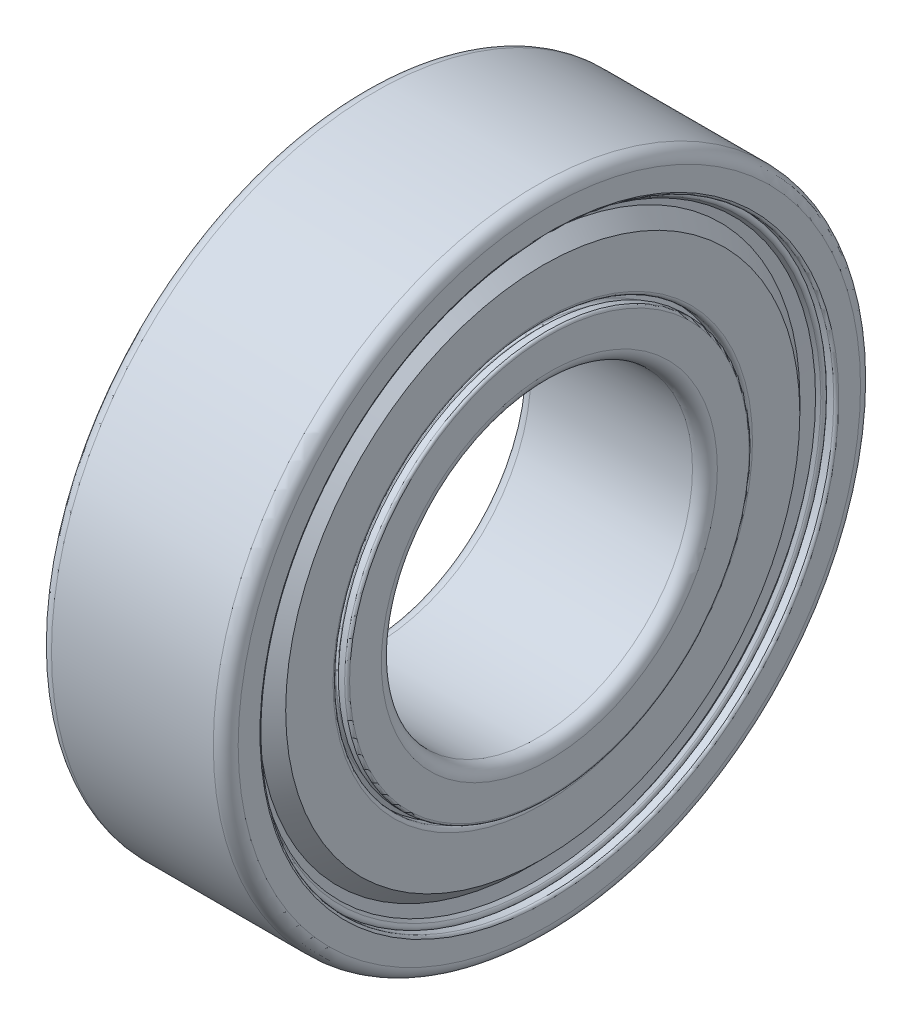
ISO-10303-21;
HEADER;
FILE_DESCRIPTION(('STEP AP214'),'2;1');
FILE_NAME('part.step','',(''),(''),'','','');
FILE_SCHEMA(('AUTOMOTIVE_DESIGN { 1 0 10303 214 1 1 1 1 }'));
ENDSEC;
DATA;
#1=APPLICATION_CONTEXT('core data for automotive mechanical design processes');
#2=APPLICATION_PROTOCOL_DEFINITION('international standard','automotive_design',2000,#1);
#3=PRODUCT_CONTEXT('',#1,'mechanical');
#4=PRODUCT('Part','Part','',(#3));
#5=PRODUCT_RELATED_PRODUCT_CATEGORY('part','',(#4));
#6=PRODUCT_DEFINITION_FORMATION('','',#4);
#7=PRODUCT_DEFINITION_CONTEXT('part definition',#1,'design');
#8=PRODUCT_DEFINITION('design','',#6,#7);
#9=PRODUCT_DEFINITION_SHAPE('','',#8);
#10=(LENGTH_UNIT() NAMED_UNIT(*) SI_UNIT(.MILLI.,.METRE.));
#11=(NAMED_UNIT(*) PLANE_ANGLE_UNIT() SI_UNIT($,.RADIAN.));
#12=(NAMED_UNIT(*) SI_UNIT($,.STERADIAN.) SOLID_ANGLE_UNIT());
#13=UNCERTAINTY_MEASURE_WITH_UNIT(LENGTH_MEASURE(1.E-05),#10,'distance_accuracy_value','');
#14=(GEOMETRIC_REPRESENTATION_CONTEXT(3) GLOBAL_UNCERTAINTY_ASSIGNED_CONTEXT((#13)) GLOBAL_UNIT_ASSIGNED_CONTEXT((#10,
#11,#12)) REPRESENTATION_CONTEXT('',''));
#15=CARTESIAN_POINT('',(0.,0.,0.));
#16=DIRECTION('',(0.,0.,1.));
#17=DIRECTION('',(1.,0.,0.));
#18=AXIS2_PLACEMENT_3D('',#15,#16,#17);
#19=CARTESIAN_POINT('',(14.,0.,0.));
#20=DIRECTION('',(-1.,0.,0.));
#21=DIRECTION('',(0.,0.,1.));
#22=AXIS2_PLACEMENT_3D('',#19,#20,#21);
#23=CYLINDRICAL_SURFACE('',#22,12.5);
#24=CARTESIAN_POINT('',(1.,0.,0.));
#25=DIRECTION('',(1.,0.,0.));
#26=DIRECTION('',(0.,0.,-1.));
#27=AXIS2_PLACEMENT_3D('',#24,#25,#26);
#28=CIRCLE('',#27,12.5);
#29=CARTESIAN_POINT('',(1.,0.,-12.5));
#30=VERTEX_POINT('',#29);
#31=EDGE_CURVE('E619',#30,#30,#28,.T.);
#32=ORIENTED_EDGE('',*,*,#31,.F.);
#33=EDGE_LOOP('',(#32));
#34=FACE_BOUND('',#33,.T.);
#35=CARTESIAN_POINT('',(14.,0.,0.));
#36=DIRECTION('',(1.,0.,0.));
#37=DIRECTION('',(0.,0.,-1.));
#38=AXIS2_PLACEMENT_3D('',#35,#36,#37);
#39=CIRCLE('',#38,12.5);
#40=CARTESIAN_POINT('',(14.,0.,-12.5));
#41=VERTEX_POINT('',#40);
#42=EDGE_CURVE('E616',#41,#41,#39,.F.);
#43=ORIENTED_EDGE('',*,*,#42,.F.);
#44=EDGE_LOOP('',(#43));
#45=FACE_BOUND('',#44,.T.);
#46=ADVANCED_FACE('F14',(#34,#45),#23,.F.);
#47=CARTESIAN_POINT('',(1.,0.,0.));
#48=DIRECTION('',(1.,0.,0.));
#49=DIRECTION('',(0.,0.,-1.));
#50=AXIS2_PLACEMENT_3D('',#47,#48,#49);
#51=TOROIDAL_SURFACE('',#50,13.5,1.);
#52=CARTESIAN_POINT('',(0.,0.,0.));
#53=DIRECTION('',(-1.,0.,0.));
#54=DIRECTION('',(0.,0.,-1.));
#55=AXIS2_PLACEMENT_3D('',#52,#53,#54);
#56=CIRCLE('',#55,13.5);
#57=CARTESIAN_POINT('',(0.,0.,-13.5));
#58=VERTEX_POINT('',#57);
#59=EDGE_CURVE('E572',#58,#58,#56,.F.);
#60=ORIENTED_EDGE('',*,*,#59,.F.);
#61=EDGE_LOOP('',(#60));
#62=FACE_BOUND('',#61,.T.);
#63=ORIENTED_EDGE('',*,*,#31,.T.);
#64=EDGE_LOOP('',(#63));
#65=FACE_BOUND('',#64,.T.);
#66=ADVANCED_FACE('F638',(#62,#65),#51,.T.);
#67=CARTESIAN_POINT('',(14.,0.,0.));
#68=DIRECTION('',(1.,0.,0.));
#69=DIRECTION('',(0.,0.,-1.));
#70=AXIS2_PLACEMENT_3D('',#67,#68,#69);
#71=TOROIDAL_SURFACE('',#70,13.5,1.);
#72=ORIENTED_EDGE('',*,*,#42,.T.);
#73=EDGE_LOOP('',(#72));
#74=FACE_BOUND('',#73,.T.);
#75=CARTESIAN_POINT('',(15.,0.,0.));
#76=DIRECTION('',(1.,0.,0.));
#77=DIRECTION('',(0.,0.,-1.));
#78=AXIS2_PLACEMENT_3D('',#75,#76,#77);
#79=CIRCLE('',#78,13.5);
#80=CARTESIAN_POINT('',(15.,0.,-13.5));
#81=VERTEX_POINT('',#80);
#82=EDGE_CURVE('E626',#81,#81,#79,.F.);
#83=ORIENTED_EDGE('',*,*,#82,.F.);
#84=EDGE_LOOP('',(#83));
#85=FACE_BOUND('',#84,.T.);
#86=ADVANCED_FACE('F589',(#74,#85),#71,.T.);
#87=CARTESIAN_POINT('',(0.,16.05,0.));
#88=DIRECTION('',(-1.,0.,0.));
#89=DIRECTION('',(0.,0.,1.));
#90=AXIS2_PLACEMENT_3D('',#87,#88,#89);
#91=PLANE('',#90);
#92=CARTESIAN_POINT('',(0.,0.,0.));
#93=DIRECTION('',(1.,0.,0.));
#94=DIRECTION('',(0.,0.,-1.));
#95=AXIS2_PLACEMENT_3D('',#92,#93,#94);
#96=CIRCLE('',#95,16.05);
#97=CARTESIAN_POINT('',(0.,0.,-16.05));
#98=VERTEX_POINT('',#97);
#99=EDGE_CURVE('E606',#98,#98,#96,.T.);
#100=ORIENTED_EDGE('',*,*,#99,.F.);
#101=EDGE_LOOP('',(#100));
#102=FACE_BOUND('',#101,.T.);
#103=ORIENTED_EDGE('',*,*,#59,.T.);
#104=EDGE_LOOP('',(#103));
#105=FACE_BOUND('',#104,.T.);
#106=ADVANCED_FACE('F579',(#102,#105),#91,.T.);
#107=CARTESIAN_POINT('',(15.,13.5,0.));
#108=DIRECTION('',(1.,0.,0.));
#109=DIRECTION('',(0.,0.,-1.));
#110=AXIS2_PLACEMENT_3D('',#107,#108,#109);
#111=PLANE('',#110);
#112=ORIENTED_EDGE('',*,*,#82,.T.);
#113=EDGE_LOOP('',(#112));
#114=FACE_BOUND('',#113,.T.);
#115=CARTESIAN_POINT('',(15.,0.,0.));
#116=DIRECTION('',(-1.,0.,0.));
#117=DIRECTION('',(0.,0.,-1.));
#118=AXIS2_PLACEMENT_3D('',#115,#116,#117);
#119=CIRCLE('',#118,16.05);
#120=CARTESIAN_POINT('',(15.,0.,-16.05));
#121=VERTEX_POINT('',#120);
#122=EDGE_CURVE('E537',#121,#121,#119,.T.);
#123=ORIENTED_EDGE('',*,*,#122,.F.);
#124=EDGE_LOOP('',(#123));
#125=FACE_BOUND('',#124,.T.);
#126=ADVANCED_FACE('F588',(#114,#125),#111,.T.);
#127=CARTESIAN_POINT('',(0.199999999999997,0.,0.));
#128=DIRECTION('',(1.,0.,0.));
#129=DIRECTION('',(0.,0.,-1.));
#130=AXIS2_PLACEMENT_3D('',#127,#128,#129);
#131=TOROIDAL_SURFACE('',#130,16.05,0.199999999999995);
#132=CARTESIAN_POINT('',(0.200000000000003,0.,0.));
#133=DIRECTION('',(-1.,0.,0.));
#134=DIRECTION('',(0.,0.,1.));
#135=AXIS2_PLACEMENT_3D('',#132,#133,#134);
#136=CIRCLE('',#135,16.25);
#137=CARTESIAN_POINT('',(0.200000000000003,0.,16.25));
#138=VERTEX_POINT('',#137);
#139=EDGE_CURVE('E532',#138,#138,#136,.F.);
#140=ORIENTED_EDGE('',*,*,#139,.F.);
#141=EDGE_LOOP('',(#140));
#142=FACE_BOUND('',#141,.T.);
#143=ORIENTED_EDGE('',*,*,#99,.T.);
#144=EDGE_LOOP('',(#143));
#145=FACE_BOUND('',#144,.T.);
#146=ADVANCED_FACE('F551',(#142,#145),#131,.T.);
#147=CARTESIAN_POINT('',(14.8,0.,0.));
#148=DIRECTION('',(1.,0.,0.));
#149=DIRECTION('',(0.,0.,-1.));
#150=AXIS2_PLACEMENT_3D('',#147,#148,#149);
#151=TOROIDAL_SURFACE('',#150,16.05,0.199999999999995);
#152=ORIENTED_EDGE('',*,*,#122,.T.);
#153=EDGE_LOOP('',(#152));
#154=FACE_BOUND('',#153,.T.);
#155=CARTESIAN_POINT('',(14.8,0.,0.));
#156=DIRECTION('',(-1.,0.,0.));
#157=DIRECTION('',(0.,0.,1.));
#158=AXIS2_PLACEMENT_3D('',#155,#156,#157);
#159=CIRCLE('',#158,16.25);
#160=CARTESIAN_POINT('',(14.8,0.,16.25));
#161=VERTEX_POINT('',#160);
#162=EDGE_CURVE('E527',#161,#161,#159,.T.);
#163=ORIENTED_EDGE('',*,*,#162,.F.);
#164=EDGE_LOOP('',(#163));
#165=FACE_BOUND('',#164,.T.);
#166=ADVANCED_FACE('F545',(#154,#165),#151,.T.);
#167=CARTESIAN_POINT('',(14.,0.,0.));
#168=DIRECTION('',(-1.,0.,0.));
#169=DIRECTION('',(0.,0.,1.));
#170=AXIS2_PLACEMENT_3D('',#167,#168,#169);
#171=CYLINDRICAL_SURFACE('',#170,16.25);
#172=CARTESIAN_POINT('',(0.700000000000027,0.,0.));
#173=DIRECTION('',(-1.,0.,0.));
#174=DIRECTION('',(0.,0.,1.));
#175=AXIS2_PLACEMENT_3D('',#172,#173,#174);
#176=CIRCLE('',#175,16.25);
#177=CARTESIAN_POINT('',(0.700000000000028,0.,16.25));
#178=VERTEX_POINT('',#177);
#179=EDGE_CURVE('E522',#178,#178,#176,.F.);
#180=ORIENTED_EDGE('',*,*,#179,.F.);
#181=EDGE_LOOP('',(#180));
#182=FACE_BOUND('',#181,.T.);
#183=ORIENTED_EDGE('',*,*,#139,.T.);
#184=EDGE_LOOP('',(#183));
#185=FACE_BOUND('',#184,.T.);
#186=ADVANCED_FACE('F550',(#182,#185),#171,.T.);
#187=CARTESIAN_POINT('',(14.,0.,0.));
#188=DIRECTION('',(-1.,0.,0.));
#189=DIRECTION('',(0.,0.,1.));
#190=AXIS2_PLACEMENT_3D('',#187,#188,#189);
#191=CYLINDRICAL_SURFACE('',#190,16.25);
#192=ORIENTED_EDGE('',*,*,#162,.T.);
#193=EDGE_LOOP('',(#192));
#194=FACE_BOUND('',#193,.T.);
#195=CARTESIAN_POINT('',(14.3,0.,0.));
#196=DIRECTION('',(1.,0.,0.));
#197=DIRECTION('',(0.,0.,-1.));
#198=AXIS2_PLACEMENT_3D('',#195,#196,#197);
#199=CIRCLE('',#198,16.25);
#200=CARTESIAN_POINT('',(14.3,0.,-16.25));
#201=VERTEX_POINT('',#200);
#202=EDGE_CURVE('E517',#201,#201,#199,.F.);
#203=ORIENTED_EDGE('',*,*,#202,.F.);
#204=EDGE_LOOP('',(#203));
#205=FACE_BOUND('',#204,.T.);
#206=ADVANCED_FACE('F1220',(#194,#205),#191,.T.);
#207=CARTESIAN_POINT('',(0.700000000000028,0.,0.));
#208=DIRECTION('',(-1.,0.,0.));
#209=DIRECTION('',(0.,0.,1.));
#210=AXIS2_PLACEMENT_3D('',#207,#208,#209);
#211=CONICAL_SURFACE('',#210,16.25,0.785398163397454);
#212=CARTESIAN_POINT('',(1.07466437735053,0.,0.));
#213=DIRECTION('',(1.,0.,0.));
#214=DIRECTION('',(0.,0.,-1.));
#215=AXIS2_PLACEMENT_3D('',#212,#213,#214);
#216=CIRCLE('',#215,15.8753356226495);
#217=CARTESIAN_POINT('',(1.07466437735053,0.,-15.8753356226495));
#218=VERTEX_POINT('',#217);
#219=EDGE_CURVE('E511',#218,#218,#216,.F.);
#220=ORIENTED_EDGE('',*,*,#219,.T.);
#221=EDGE_LOOP('',(#220));
#222=FACE_BOUND('',#221,.T.);
#223=ORIENTED_EDGE('',*,*,#179,.T.);
#224=EDGE_LOOP('',(#223));
#225=FACE_BOUND('',#224,.T.);
#226=ADVANCED_FACE('F1213',(#222,#225),#211,.T.);
#227=CARTESIAN_POINT('',(14.3,0.,0.));
#228=DIRECTION('',(1.,0.,0.));
#229=DIRECTION('',(0.,0.,-1.));
#230=AXIS2_PLACEMENT_3D('',#227,#228,#229);
#231=CONICAL_SURFACE('',#230,16.25,0.785398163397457);
#232=ORIENTED_EDGE('',*,*,#202,.T.);
#233=EDGE_LOOP('',(#232));
#234=FACE_BOUND('',#233,.T.);
#235=CARTESIAN_POINT('',(13.9252967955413,0.,0.));
#236=DIRECTION('',(1.,0.,0.));
#237=DIRECTION('',(0.,0.,-1.));
#238=AXIS2_PLACEMENT_3D('',#235,#236,#237);
#239=CIRCLE('',#238,15.8752967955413);
#240=CARTESIAN_POINT('',(13.9252967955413,0.,-15.8752967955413));
#241=VERTEX_POINT('',#240);
#242=EDGE_CURVE('E508',#241,#241,#239,.T.);
#243=ORIENTED_EDGE('',*,*,#242,.T.);
#244=EDGE_LOOP('',(#243));
#245=FACE_BOUND('',#244,.T.);
#246=ADVANCED_FACE('F1206',(#234,#245),#231,.T.);
#247=CARTESIAN_POINT('',(1.49892900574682,0.,0.));
#248=DIRECTION('',(1.,0.,0.));
#249=DIRECTION('',(0.,0.,-1.));
#250=AXIS2_PLACEMENT_3D('',#247,#248,#249);
#251=TOROIDAL_SURFACE('',#250,16.2995991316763,0.599999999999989);
#252=ORIENTED_EDGE('',*,*,#219,.F.);
#253=EDGE_LOOP('',(#252));
#254=FACE_BOUND('',#253,.T.);
#255=CARTESIAN_POINT('',(1.47699999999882,0.,0.));
#256=DIRECTION('',(1.,0.,0.));
#257=DIRECTION('',(0.,0.,-1.));
#258=AXIS2_PLACEMENT_3D('',#255,#256,#257);
#259=CIRCLE('',#258,15.7);
#260=CARTESIAN_POINT('',(1.47699999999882,0.,-15.7));
#261=VERTEX_POINT('',#260);
#262=EDGE_CURVE('E487',#261,#261,#259,.F.);
#263=ORIENTED_EDGE('',*,*,#262,.T.);
#264=EDGE_LOOP('',(#263));
#265=FACE_BOUND('',#264,.T.);
#266=ADVANCED_FACE('F501',(#254,#265),#251,.F.);
#267=CARTESIAN_POINT('',(13.5010320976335,0.,0.));
#268=DIRECTION('',(1.,0.,0.));
#269=DIRECTION('',(0.,0.,-1.));
#270=AXIS2_PLACEMENT_3D('',#267,#268,#269);
#271=TOROIDAL_SURFACE('',#270,16.2995602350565,0.600000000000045);
#272=CARTESIAN_POINT('',(13.5239999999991,0.,0.));
#273=DIRECTION('',(1.,0.,0.));
#274=DIRECTION('',(0.,0.,-1.));
#275=AXIS2_PLACEMENT_3D('',#272,#273,#274);
#276=CIRCLE('',#275,15.7);
#277=CARTESIAN_POINT('',(13.5239999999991,0.,-15.7));
#278=VERTEX_POINT('',#277);
#279=EDGE_CURVE('E481',#278,#278,#276,.T.);
#280=ORIENTED_EDGE('',*,*,#279,.T.);
#281=EDGE_LOOP('',(#280));
#282=FACE_BOUND('',#281,.T.);
#283=ORIENTED_EDGE('',*,*,#242,.F.);
#284=EDGE_LOOP('',(#283));
#285=FACE_BOUND('',#284,.T.);
#286=ADVANCED_FACE('F496',(#282,#285),#271,.F.);
#287=CARTESIAN_POINT('',(1.49074818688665,0.,0.));
#288=DIRECTION('',(1.,0.,0.));
#289=DIRECTION('',(0.,0.,-1.));
#290=AXIS2_PLACEMENT_3D('',#287,#288,#289);
#291=TOROIDAL_SURFACE('',#290,16.2998424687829,0.599999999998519);
#292=ORIENTED_EDGE('',*,*,#262,.F.);
#293=EDGE_LOOP('',(#292));
#294=FACE_BOUND('',#293,.T.);
#295=CARTESIAN_POINT('',(1.52800000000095,0.,0.));
#296=DIRECTION('',(1.,0.,0.));
#297=DIRECTION('',(0.,0.,-1.));
#298=AXIS2_PLACEMENT_3D('',#295,#296,#297);
#299=CIRCLE('',#298,15.701);
#300=CARTESIAN_POINT('',(1.52800000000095,0.,-15.701));
#301=VERTEX_POINT('',#300);
#302=EDGE_CURVE('E478',#301,#301,#299,.F.);
#303=ORIENTED_EDGE('',*,*,#302,.T.);
#304=EDGE_LOOP('',(#303));
#305=FACE_BOUND('',#304,.T.);
#306=ADVANCED_FACE('F493',(#294,#305),#291,.F.);
#307=CARTESIAN_POINT('',(13.5102518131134,0.,0.));
#308=DIRECTION('',(1.,0.,0.));
#309=DIRECTION('',(0.,0.,-1.));
#310=AXIS2_PLACEMENT_3D('',#307,#308,#309);
#311=TOROIDAL_SURFACE('',#310,16.2998424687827,0.599999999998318);
#312=CARTESIAN_POINT('',(13.4729999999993,0.,0.));
#313=DIRECTION('',(1.,0.,0.));
#314=DIRECTION('',(0.,0.,-1.));
#315=AXIS2_PLACEMENT_3D('',#312,#313,#314);
#316=CIRCLE('',#315,15.701);
#317=CARTESIAN_POINT('',(13.4729999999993,0.,-15.701));
#318=VERTEX_POINT('',#317);
#319=EDGE_CURVE('E455',#318,#318,#316,.T.);
#320=ORIENTED_EDGE('',*,*,#319,.T.);
#321=EDGE_LOOP('',(#320));
#322=FACE_BOUND('',#321,.T.);
#323=ORIENTED_EDGE('',*,*,#279,.F.);
#324=EDGE_LOOP('',(#323));
#325=FACE_BOUND('',#324,.T.);
#326=ADVANCED_FACE('F471',(#322,#325),#311,.F.);
#327=CARTESIAN_POINT('',(1.50012717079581,0.,0.));
#328=DIRECTION('',(1.,0.,0.));
#329=DIRECTION('',(0.,0.,-1.));
#330=AXIS2_PLACEMENT_3D('',#327,#328,#329);
#331=TOROIDAL_SURFACE('',#330,15.9997023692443,0.300000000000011);
#332=ORIENTED_EDGE('',*,*,#302,.F.);
#333=EDGE_LOOP('',(#332));
#334=FACE_BOUND('',#333,.T.);
#335=CARTESIAN_POINT('',(1.78208939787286,0.,0.));
#336=DIRECTION('',(1.,0.,0.));
#337=DIRECTION('',(0.,0.,-1.));
#338=AXIS2_PLACEMENT_3D('',#335,#336,#337);
#339=CIRCLE('',#338,15.8972460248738);
#340=CARTESIAN_POINT('',(1.78208939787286,0.,-15.8972460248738));
#341=VERTEX_POINT('',#340);
#342=EDGE_CURVE('E450',#341,#341,#339,.T.);
#343=ORIENTED_EDGE('',*,*,#342,.F.);
#344=EDGE_LOOP('',(#343));
#345=FACE_BOUND('',#344,.T.);
#346=ADVANCED_FACE('F466',(#334,#345),#331,.F.);
#347=CARTESIAN_POINT('',(13.4998384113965,0.,0.));
#348=DIRECTION('',(1.,0.,0.));
#349=DIRECTION('',(0.,0.,-1.));
#350=AXIS2_PLACEMENT_3D('',#347,#348,#349);
#351=TOROIDAL_SURFACE('',#350,15.9997970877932,0.3);
#352=CARTESIAN_POINT('',(13.2178761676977,0.,0.));
#353=DIRECTION('',(-1.,0.,0.));
#354=DIRECTION('',(0.,0.,1.));
#355=AXIS2_PLACEMENT_3D('',#352,#353,#354);
#356=CIRCLE('',#355,15.8973407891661);
#357=CARTESIAN_POINT('',(13.2178761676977,0.,15.8973407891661));
#358=VERTEX_POINT('',#357);
#359=EDGE_CURVE('E445',#358,#358,#356,.T.);
#360=ORIENTED_EDGE('',*,*,#359,.F.);
#361=EDGE_LOOP('',(#360));
#362=FACE_BOUND('',#361,.T.);
#363=ORIENTED_EDGE('',*,*,#319,.F.);
#364=EDGE_LOOP('',(#363));
#365=FACE_BOUND('',#364,.T.);
#366=ADVANCED_FACE('F462',(#362,#365),#351,.F.);
#367=CARTESIAN_POINT('',(2.15311053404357,0.,0.));
#368=DIRECTION('',(1.,0.,0.));
#369=DIRECTION('',(0.,0.,-1.));
#370=AXIS2_PLACEMENT_3D('',#367,#368,#369);
#371=CONICAL_SURFACE('',#370,16.9183041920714,1.22226126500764);
#372=CARTESIAN_POINT('',(2.15311053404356,0.,0.));
#373=DIRECTION('',(1.,0.,0.));
#374=DIRECTION('',(0.,0.,-1.));
#375=AXIS2_PLACEMENT_3D('',#372,#373,#374);
#376=CIRCLE('',#375,16.9183041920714);
#377=CARTESIAN_POINT('',(2.15311053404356,0.,-16.9183041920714));
#378=VERTEX_POINT('',#377);
#379=EDGE_CURVE('E442',#378,#378,#376,.T.);
#380=ORIENTED_EDGE('',*,*,#379,.F.);
#381=EDGE_LOOP('',(#380));
#382=FACE_BOUND('',#381,.T.);
#383=ORIENTED_EDGE('',*,*,#342,.T.);
#384=EDGE_LOOP('',(#383));
#385=FACE_BOUND('',#384,.T.);
#386=ADVANCED_FACE('F465',(#382,#385),#371,.T.);
#387=CARTESIAN_POINT('',(12.8468894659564,0.,0.));
#388=DIRECTION('',(-1.,0.,0.));
#389=DIRECTION('',(0.,0.,1.));
#390=AXIS2_PLACEMENT_3D('',#387,#388,#389);
#391=CONICAL_SURFACE('',#390,16.9183041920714,1.22226126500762);
#392=ORIENTED_EDGE('',*,*,#359,.T.);
#393=EDGE_LOOP('',(#392));
#394=FACE_BOUND('',#393,.T.);
#395=CARTESIAN_POINT('',(12.8468894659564,0.,0.));
#396=DIRECTION('',(1.,0.,0.));
#397=DIRECTION('',(0.,0.,-1.));
#398=AXIS2_PLACEMENT_3D('',#395,#396,#397);
#399=CIRCLE('',#398,16.9183041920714);
#400=CARTESIAN_POINT('',(12.8468894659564,0.,-16.9183041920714));
#401=VERTEX_POINT('',#400);
#402=EDGE_CURVE('E420',#401,#401,#399,.F.);
#403=ORIENTED_EDGE('',*,*,#402,.F.);
#404=EDGE_LOOP('',(#403));
#405=FACE_BOUND('',#404,.T.);
#406=ADVANCED_FACE('F436',(#394,#405),#391,.T.);
#407=CARTESIAN_POINT('',(2.34108536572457,0.,0.));
#408=DIRECTION('',(1.,0.,0.));
#409=DIRECTION('',(0.,0.,-1.));
#410=AXIS2_PLACEMENT_3D('',#407,#408,#409);
#411=TOROIDAL_SURFACE('',#410,16.85,0.20000000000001);
#412=CARTESIAN_POINT('',(2.3410850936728,0.,0.));
#413=DIRECTION('',(-1.,0.,0.));
#414=DIRECTION('',(0.,0.,1.));
#415=AXIS2_PLACEMENT_3D('',#412,#413,#414);
#416=CIRCLE('',#415,17.05);
#417=CARTESIAN_POINT('',(2.3410850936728,0.,17.05));
#418=VERTEX_POINT('',#417);
#419=EDGE_CURVE('E415',#418,#418,#416,.F.);
#420=ORIENTED_EDGE('',*,*,#419,.F.);
#421=EDGE_LOOP('',(#420));
#422=FACE_BOUND('',#421,.T.);
#423=ORIENTED_EDGE('',*,*,#379,.T.);
#424=EDGE_LOOP('',(#423));
#425=FACE_BOUND('',#424,.T.);
#426=ADVANCED_FACE('F431',(#422,#425),#411,.T.);
#427=CARTESIAN_POINT('',(12.6589146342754,0.,0.));
#428=DIRECTION('',(1.,0.,0.));
#429=DIRECTION('',(0.,0.,-1.));
#430=AXIS2_PLACEMENT_3D('',#427,#428,#429);
#431=TOROIDAL_SURFACE('',#430,16.85,0.200000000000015);
#432=ORIENTED_EDGE('',*,*,#402,.T.);
#433=EDGE_LOOP('',(#432));
#434=FACE_BOUND('',#433,.T.);
#435=CARTESIAN_POINT('',(12.6589149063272,0.,0.));
#436=DIRECTION('',(-1.,0.,0.));
#437=DIRECTION('',(0.,0.,1.));
#438=AXIS2_PLACEMENT_3D('',#435,#436,#437);
#439=CIRCLE('',#438,17.05);
#440=CARTESIAN_POINT('',(12.6589149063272,0.,17.05));
#441=VERTEX_POINT('',#440);
#442=EDGE_CURVE('E410',#441,#441,#439,.T.);
#443=ORIENTED_EDGE('',*,*,#442,.F.);
#444=EDGE_LOOP('',(#443));
#445=FACE_BOUND('',#444,.T.);
#446=ADVANCED_FACE('F427',(#434,#445),#431,.T.);
#447=CARTESIAN_POINT('',(14.,0.,0.));
#448=DIRECTION('',(-1.,0.,0.));
#449=DIRECTION('',(0.,0.,1.));
#450=AXIS2_PLACEMENT_3D('',#447,#448,#449);
#451=CYLINDRICAL_SURFACE('',#450,17.05);
#452=CARTESIAN_POINT('',(4.37799999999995,0.,0.));
#453=DIRECTION('',(1.,0.,0.));
#454=DIRECTION('',(0.,0.,-1.));
#455=AXIS2_PLACEMENT_3D('',#452,#453,#454);
#456=CIRCLE('',#455,17.05);
#457=CARTESIAN_POINT('',(4.37799999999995,0.,-17.05));
#458=VERTEX_POINT('',#457);
#459=EDGE_CURVE('E407',#458,#458,#456,.T.);
#460=ORIENTED_EDGE('',*,*,#459,.F.);
#461=EDGE_LOOP('',(#460));
#462=FACE_BOUND('',#461,.T.);
#463=ORIENTED_EDGE('',*,*,#419,.T.);
#464=EDGE_LOOP('',(#463));
#465=FACE_BOUND('',#464,.T.);
#466=ADVANCED_FACE('F430',(#462,#465),#451,.T.);
#467=CARTESIAN_POINT('',(14.,0.,0.));
#468=DIRECTION('',(-1.,0.,0.));
#469=DIRECTION('',(0.,0.,1.));
#470=AXIS2_PLACEMENT_3D('',#467,#468,#469);
#471=CYLINDRICAL_SURFACE('',#470,17.05);
#472=ORIENTED_EDGE('',*,*,#442,.T.);
#473=EDGE_LOOP('',(#472));
#474=FACE_BOUND('',#473,.T.);
#475=CARTESIAN_POINT('',(10.622,0.,0.));
#476=DIRECTION('',(1.,0.,0.));
#477=DIRECTION('',(0.,0.,-1.));
#478=AXIS2_PLACEMENT_3D('',#475,#476,#477);
#479=CIRCLE('',#478,17.05);
#480=CARTESIAN_POINT('',(10.622,0.,-17.05));
#481=VERTEX_POINT('',#480);
#482=EDGE_CURVE('E385',#481,#481,#479,.F.);
#483=ORIENTED_EDGE('',*,*,#482,.F.);
#484=EDGE_LOOP('',(#483));
#485=FACE_BOUND('',#484,.T.);
#486=ADVANCED_FACE('F401',(#474,#485),#471,.T.);
#487=CARTESIAN_POINT('',(7.50057281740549,0.,0.));
#488=DIRECTION('',(1.,0.,0.));
#489=DIRECTION('',(0.,0.,-1.));
#490=AXIS2_PLACEMENT_3D('',#487,#488,#489);
#491=TOROIDAL_SURFACE('',#490,19.5,3.969);
#492=CARTESIAN_POINT('',(4.37799999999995,0.,0.));
#493=DIRECTION('',(-1.,0.,0.));
#494=DIRECTION('',(0.,0.,1.));
#495=AXIS2_PLACEMENT_3D('',#492,#493,#494);
#496=CIRCLE('',#495,21.95);
#497=CARTESIAN_POINT('',(4.37799999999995,0.,21.95));
#498=VERTEX_POINT('',#497);
#499=EDGE_CURVE('E380',#498,#498,#496,.T.);
#500=ORIENTED_EDGE('',*,*,#499,.T.);
#501=EDGE_LOOP('',(#500));
#502=FACE_BOUND('',#501,.T.);
#503=ORIENTED_EDGE('',*,*,#459,.T.);
#504=EDGE_LOOP('',(#503));
#505=FACE_BOUND('',#504,.T.);
#506=ADVANCED_FACE('F396',(#502,#505),#491,.T.);
#507=CARTESIAN_POINT('',(7.49942718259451,0.,0.));
#508=DIRECTION('',(1.,0.,0.));
#509=DIRECTION('',(0.,0.,-1.));
#510=AXIS2_PLACEMENT_3D('',#507,#508,#509);
#511=TOROIDAL_SURFACE('',#510,19.5,3.969);
#512=ORIENTED_EDGE('',*,*,#482,.T.);
#513=EDGE_LOOP('',(#512));
#514=FACE_BOUND('',#513,.T.);
#515=CARTESIAN_POINT('',(10.622,0.,0.));
#516=DIRECTION('',(-1.,0.,0.));
#517=DIRECTION('',(0.,0.,1.));
#518=AXIS2_PLACEMENT_3D('',#515,#516,#517);
#519=CIRCLE('',#518,21.95);
#520=CARTESIAN_POINT('',(10.622,0.,21.95));
#521=VERTEX_POINT('',#520);
#522=EDGE_CURVE('E375',#521,#521,#519,.F.);
#523=ORIENTED_EDGE('',*,*,#522,.T.);
#524=EDGE_LOOP('',(#523));
#525=FACE_BOUND('',#524,.T.);
#526=ADVANCED_FACE('F392',(#514,#525),#511,.T.);
#527=CARTESIAN_POINT('',(14.,0.,0.));
#528=DIRECTION('',(-1.,0.,0.));
#529=DIRECTION('',(0.,0.,1.));
#530=AXIS2_PLACEMENT_3D('',#527,#528,#529);
#531=CYLINDRICAL_SURFACE('',#530,21.95);
#532=CARTESIAN_POINT('',(2.15918836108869,0.,0.));
#533=DIRECTION('',(1.,0.,0.));
#534=DIRECTION('',(0.,0.,-1.));
#535=AXIS2_PLACEMENT_3D('',#532,#533,#534);
#536=CIRCLE('',#535,21.95);
#537=CARTESIAN_POINT('',(2.15918836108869,0.,-21.95));
#538=VERTEX_POINT('',#537);
#539=EDGE_CURVE('E372',#538,#538,#536,.T.);
#540=ORIENTED_EDGE('',*,*,#539,.F.);
#541=EDGE_LOOP('',(#540));
#542=FACE_BOUND('',#541,.T.);
#543=ORIENTED_EDGE('',*,*,#499,.F.);
#544=EDGE_LOOP('',(#543));
#545=FACE_BOUND('',#544,.T.);
#546=ADVANCED_FACE('F395',(#542,#545),#531,.F.);
#547=CARTESIAN_POINT('',(14.,0.,0.));
#548=DIRECTION('',(-1.,0.,0.));
#549=DIRECTION('',(0.,0.,1.));
#550=AXIS2_PLACEMENT_3D('',#547,#548,#549);
#551=CYLINDRICAL_SURFACE('',#550,21.95);
#552=ORIENTED_EDGE('',*,*,#522,.F.);
#553=EDGE_LOOP('',(#552));
#554=FACE_BOUND('',#553,.T.);
#555=CARTESIAN_POINT('',(12.8408116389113,0.,0.));
#556=DIRECTION('',(1.,0.,0.));
#557=DIRECTION('',(0.,0.,-1.));
#558=AXIS2_PLACEMENT_3D('',#555,#556,#557);
#559=CIRCLE('',#558,21.95);
#560=CARTESIAN_POINT('',(12.8408116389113,0.,-21.95));
#561=VERTEX_POINT('',#560);
#562=EDGE_CURVE('E348',#561,#561,#559,.F.);
#563=ORIENTED_EDGE('',*,*,#562,.F.);
#564=EDGE_LOOP('',(#563));
#565=FACE_BOUND('',#564,.T.);
#566=ADVANCED_FACE('F366',(#554,#565),#551,.F.);
#567=CARTESIAN_POINT('',(2.15918950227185,0.,0.));
#568=DIRECTION('',(1.,0.,0.));
#569=DIRECTION('',(0.,0.,-1.));
#570=AXIS2_PLACEMENT_3D('',#567,#568,#569);
#571=TOROIDAL_SURFACE('',#570,22.1499999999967,0.200000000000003);
#572=CARTESIAN_POINT('',(1.95994138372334,0.,0.));
#573=DIRECTION('',(-1.,0.,0.));
#574=DIRECTION('',(0.,0.,1.));
#575=AXIS2_PLACEMENT_3D('',#572,#573,#574);
#576=CIRCLE('',#575,22.1326740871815);
#577=CARTESIAN_POINT('',(1.95994138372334,0.,22.1326740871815));
#578=VERTEX_POINT('',#577);
#579=EDGE_CURVE('E343',#578,#578,#576,.T.);
#580=ORIENTED_EDGE('',*,*,#579,.T.);
#581=EDGE_LOOP('',(#580));
#582=FACE_BOUND('',#581,.T.);
#583=ORIENTED_EDGE('',*,*,#539,.T.);
#584=EDGE_LOOP('',(#583));
#585=FACE_BOUND('',#584,.T.);
#586=ADVANCED_FACE('F360',(#582,#585),#571,.T.);
#587=CARTESIAN_POINT('',(12.8408106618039,0.,0.));
#588=DIRECTION('',(1.,0.,0.));
#589=DIRECTION('',(0.,0.,-1.));
#590=AXIS2_PLACEMENT_3D('',#587,#588,#589);
#591=TOROIDAL_SURFACE('',#590,22.1499999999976,0.199999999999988);
#592=ORIENTED_EDGE('',*,*,#562,.T.);
#593=EDGE_LOOP('',(#592));
#594=FACE_BOUND('',#593,.T.);
#595=CARTESIAN_POINT('',(13.040054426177,0.,0.));
#596=DIRECTION('',(1.,0.,0.));
#597=DIRECTION('',(0.,0.,-1.));
#598=AXIS2_PLACEMENT_3D('',#595,#596,#597);
#599=CIRCLE('',#598,22.1326240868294);
#600=CARTESIAN_POINT('',(13.040054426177,0.,-22.1326240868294));
#601=VERTEX_POINT('',#600);
#602=EDGE_CURVE('E335',#601,#601,#599,.T.);
#603=ORIENTED_EDGE('',*,*,#602,.T.);
#604=EDGE_LOOP('',(#603));
#605=FACE_BOUND('',#604,.T.);
#606=ADVANCED_FACE('F355',(#594,#605),#591,.T.);
#607=CARTESIAN_POINT('',(1.93,0.,0.));
#608=DIRECTION('',(-1.,0.,0.));
#609=DIRECTION('',(0.,0.,1.));
#610=AXIS2_PLACEMENT_3D('',#607,#608,#609);
#611=CONICAL_SURFACE('',#610,22.477,1.48405798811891);
#612=CARTESIAN_POINT('',(1.93,0.,0.));
#613=DIRECTION('',(-1.,0.,0.));
#614=DIRECTION('',(0.,0.,1.));
#615=AXIS2_PLACEMENT_3D('',#612,#613,#614);
#616=CIRCLE('',#615,22.477);
#617=CARTESIAN_POINT('',(1.93,0.,22.477));
#618=VERTEX_POINT('',#617);
#619=EDGE_CURVE('E17',#618,#618,#616,.F.);
#620=ORIENTED_EDGE('',*,*,#619,.F.);
#621=EDGE_LOOP('',(#620));
#622=FACE_BOUND('',#621,.T.);
#623=ORIENTED_EDGE('',*,*,#579,.F.);
#624=EDGE_LOOP('',(#623));
#625=FACE_BOUND('',#624,.T.);
#626=ADVANCED_FACE('F359',(#622,#625),#611,.F.);
#627=CARTESIAN_POINT('',(13.07,0.,0.));
#628=DIRECTION('',(1.,0.,0.));
#629=DIRECTION('',(0.,0.,-1.));
#630=AXIS2_PLACEMENT_3D('',#627,#628,#629);
#631=CONICAL_SURFACE('',#630,22.476,1.48380711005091);
#632=ORIENTED_EDGE('',*,*,#602,.F.);
#633=EDGE_LOOP('',(#632));
#634=FACE_BOUND('',#633,.T.);
#635=CARTESIAN_POINT('',(13.07,0.,0.));
#636=DIRECTION('',(1.,0.,0.));
#637=DIRECTION('',(0.,0.,-1.));
#638=AXIS2_PLACEMENT_3D('',#635,#636,#637);
#639=CIRCLE('',#638,22.476);
#640=CARTESIAN_POINT('',(13.07,0.,-22.476));
#641=VERTEX_POINT('',#640);
#642=EDGE_CURVE('E686',#641,#641,#639,.F.);
#643=ORIENTED_EDGE('',*,*,#642,.F.);
#644=EDGE_LOOP('',(#643));
#645=FACE_BOUND('',#644,.T.);
#646=ADVANCED_FACE('F697',(#634,#645),#631,.F.);
#647=CARTESIAN_POINT('',(1.93,21.63,0.));
#648=DIRECTION('',(1.,0.,0.));
#649=DIRECTION('',(0.,0.,-1.));
#650=AXIS2_PLACEMENT_3D('',#647,#648,#649);
#651=PLANE('',#650);
#652=CARTESIAN_POINT('',(1.93,0.,0.));
#653=DIRECTION('',(1.,0.,0.));
#654=DIRECTION('',(0.,1.,0.));
#655=AXIS2_PLACEMENT_3D('',#652,#653,#654);
#656=CIRCLE('',#655,21.63);
#657=CARTESIAN_POINT('',(1.93,21.63,0.));
#658=VERTEX_POINT('',#657);
#659=EDGE_CURVE('E684',#658,#658,#656,.F.);
#660=ORIENTED_EDGE('',*,*,#659,.T.);
#661=EDGE_LOOP('',(#660));
#662=FACE_BOUND('',#661,.T.);
#663=ORIENTED_EDGE('',*,*,#619,.T.);
#664=EDGE_LOOP('',(#663));
#665=FACE_BOUND('',#664,.T.);
#666=ADVANCED_FACE('F693',(#662,#665),#651,.T.);
#667=CARTESIAN_POINT('',(13.07,22.476,0.));
#668=DIRECTION('',(-1.,0.,0.));
#669=DIRECTION('',(0.,0.,1.));
#670=AXIS2_PLACEMENT_3D('',#667,#668,#669);
#671=PLANE('',#670);
#672=ORIENTED_EDGE('',*,*,#642,.T.);
#673=EDGE_LOOP('',(#672));
#674=FACE_BOUND('',#673,.T.);
#675=CARTESIAN_POINT('',(13.07,0.,0.));
#676=DIRECTION('',(-1.,0.,0.));
#677=DIRECTION('',(0.,0.,1.));
#678=AXIS2_PLACEMENT_3D('',#675,#676,#677);
#679=CIRCLE('',#678,21.63);
#680=CARTESIAN_POINT('',(13.07,0.,21.63));
#681=VERTEX_POINT('',#680);
#682=EDGE_CURVE('E681',#681,#681,#679,.F.);
#683=ORIENTED_EDGE('',*,*,#682,.T.);
#684=EDGE_LOOP('',(#683));
#685=FACE_BOUND('',#684,.T.);
#686=ADVANCED_FACE('F1021',(#674,#685),#671,.T.);
#687=CARTESIAN_POINT('',(1.93,0.,0.));
#688=DIRECTION('',(1.,0.,0.));
#689=DIRECTION('',(0.,1.,0.));
#690=AXIS2_PLACEMENT_3D('',#687,#688,#689);
#691=CONICAL_SURFACE('',#690,21.63,0.78539816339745);
#692=CARTESIAN_POINT('',(0.83,0.,0.));
#693=DIRECTION('',(1.,0.,0.));
#694=DIRECTION('',(0.,1.,0.));
#695=AXIS2_PLACEMENT_3D('',#692,#693,#694);
#696=CIRCLE('',#695,20.53);
#697=CARTESIAN_POINT('',(0.83,20.53,0.));
#698=VERTEX_POINT('',#697);
#699=EDGE_CURVE('E678',#698,#698,#696,.T.);
#700=ORIENTED_EDGE('',*,*,#699,.F.);
#701=EDGE_LOOP('',(#700));
#702=FACE_BOUND('',#701,.T.);
#703=ORIENTED_EDGE('',*,*,#659,.F.);
#704=EDGE_LOOP('',(#703));
#705=FACE_BOUND('',#704,.T.);
#706=ADVANCED_FACE('F1012',(#702,#705),#691,.F.);
#707=CARTESIAN_POINT('',(13.07,0.,0.));
#708=DIRECTION('',(-1.,0.,0.));
#709=DIRECTION('',(0.,0.,1.));
#710=AXIS2_PLACEMENT_3D('',#707,#708,#709);
#711=CONICAL_SURFACE('',#710,21.63,0.785398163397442);
#712=ORIENTED_EDGE('',*,*,#682,.F.);
#713=EDGE_LOOP('',(#712));
#714=FACE_BOUND('',#713,.T.);
#715=CARTESIAN_POINT('',(14.17,0.,0.));
#716=DIRECTION('',(-1.,0.,0.));
#717=DIRECTION('',(0.,0.,1.));
#718=AXIS2_PLACEMENT_3D('',#715,#716,#717);
#719=CIRCLE('',#718,20.53);
#720=CARTESIAN_POINT('',(14.17,0.,20.53));
#721=VERTEX_POINT('',#720);
#722=EDGE_CURVE('E675',#721,#721,#719,.T.);
#723=ORIENTED_EDGE('',*,*,#722,.F.);
#724=EDGE_LOOP('',(#723));
#725=FACE_BOUND('',#724,.T.);
#726=ADVANCED_FACE('F1003',(#714,#725),#711,.F.);
#727=CARTESIAN_POINT('',(0.83,16.85,0.));
#728=DIRECTION('',(1.,0.,0.));
#729=DIRECTION('',(0.,0.,-1.));
#730=AXIS2_PLACEMENT_3D('',#727,#728,#729);
#731=PLANE('',#730);
#732=CARTESIAN_POINT('',(0.83,0.,0.));
#733=DIRECTION('',(-1.,0.,0.));
#734=DIRECTION('',(0.,0.,1.));
#735=AXIS2_PLACEMENT_3D('',#732,#733,#734);
#736=CIRCLE('',#735,16.85);
#737=CARTESIAN_POINT('',(0.83,0.,16.85));
#738=VERTEX_POINT('',#737);
#739=EDGE_CURVE('E672',#738,#738,#736,.F.);
#740=ORIENTED_EDGE('',*,*,#739,.F.);
#741=EDGE_LOOP('',(#740));
#742=FACE_BOUND('',#741,.T.);
#743=ORIENTED_EDGE('',*,*,#699,.T.);
#744=EDGE_LOOP('',(#743));
#745=FACE_BOUND('',#744,.T.);
#746=ADVANCED_FACE('F994',(#742,#745),#731,.T.);
#747=CARTESIAN_POINT('',(14.17,20.53,0.));
#748=DIRECTION('',(-1.,0.,0.));
#749=DIRECTION('',(0.,0.,1.));
#750=AXIS2_PLACEMENT_3D('',#747,#748,#749);
#751=PLANE('',#750);
#752=ORIENTED_EDGE('',*,*,#722,.T.);
#753=EDGE_LOOP('',(#752));
#754=FACE_BOUND('',#753,.T.);
#755=CARTESIAN_POINT('',(14.17,0.,0.));
#756=DIRECTION('',(-1.,0.,0.));
#757=DIRECTION('',(0.,0.,1.));
#758=AXIS2_PLACEMENT_3D('',#755,#756,#757);
#759=CIRCLE('',#758,16.85);
#760=CARTESIAN_POINT('',(14.17,0.,16.85));
#761=VERTEX_POINT('',#760);
#762=EDGE_CURVE('E669',#761,#761,#759,.T.);
#763=ORIENTED_EDGE('',*,*,#762,.F.);
#764=EDGE_LOOP('',(#763));
#765=FACE_BOUND('',#764,.T.);
#766=ADVANCED_FACE('F985',(#754,#765),#751,.T.);
#767=CARTESIAN_POINT('',(14.,0.,0.));
#768=DIRECTION('',(-1.,0.,0.));
#769=DIRECTION('',(0.,0.,1.));
#770=AXIS2_PLACEMENT_3D('',#767,#768,#769);
#771=CYLINDRICAL_SURFACE('',#770,16.85);
#772=CARTESIAN_POINT('',(1.45,0.,0.));
#773=DIRECTION('',(-1.,0.,0.));
#774=DIRECTION('',(0.,0.,1.));
#775=AXIS2_PLACEMENT_3D('',#772,#773,#774);
#776=CIRCLE('',#775,16.85);
#777=CARTESIAN_POINT('',(1.45,0.,16.85));
#778=VERTEX_POINT('',#777);
#779=EDGE_CURVE('E666',#778,#778,#776,.F.);
#780=ORIENTED_EDGE('',*,*,#779,.F.);
#781=EDGE_LOOP('',(#780));
#782=FACE_BOUND('',#781,.T.);
#783=ORIENTED_EDGE('',*,*,#739,.T.);
#784=EDGE_LOOP('',(#783));
#785=FACE_BOUND('',#784,.T.);
#786=ADVANCED_FACE('F976',(#782,#785),#771,.T.);
#787=CARTESIAN_POINT('',(14.,0.,0.));
#788=DIRECTION('',(-1.,0.,0.));
#789=DIRECTION('',(0.,0.,1.));
#790=AXIS2_PLACEMENT_3D('',#787,#788,#789);
#791=CYLINDRICAL_SURFACE('',#790,16.85);
#792=ORIENTED_EDGE('',*,*,#762,.T.);
#793=EDGE_LOOP('',(#792));
#794=FACE_BOUND('',#793,.T.);
#795=CARTESIAN_POINT('',(13.55,0.,0.));
#796=DIRECTION('',(-1.,0.,0.));
#797=DIRECTION('',(0.,0.,1.));
#798=AXIS2_PLACEMENT_3D('',#795,#796,#797);
#799=CIRCLE('',#798,16.85);
#800=CARTESIAN_POINT('',(13.55,0.,16.85));
#801=VERTEX_POINT('',#800);
#802=EDGE_CURVE('E663',#801,#801,#799,.T.);
#803=ORIENTED_EDGE('',*,*,#802,.F.);
#804=EDGE_LOOP('',(#803));
#805=FACE_BOUND('',#804,.T.);
#806=ADVANCED_FACE('F967',(#794,#805),#791,.T.);
#807=CARTESIAN_POINT('',(1.45,16.55,0.));
#808=DIRECTION('',(1.,0.,0.));
#809=DIRECTION('',(0.,0.,-1.));
#810=AXIS2_PLACEMENT_3D('',#807,#808,#809);
#811=PLANE('',#810);
#812=CARTESIAN_POINT('',(1.45,0.,0.));
#813=DIRECTION('',(-1.,0.,0.));
#814=DIRECTION('',(0.,0.,1.));
#815=AXIS2_PLACEMENT_3D('',#812,#813,#814);
#816=CIRCLE('',#815,16.55);
#817=CARTESIAN_POINT('',(1.45,0.,16.55));
#818=VERTEX_POINT('',#817);
#819=EDGE_CURVE('E660',#818,#818,#816,.T.);
#820=ORIENTED_EDGE('',*,*,#819,.T.);
#821=EDGE_LOOP('',(#820));
#822=FACE_BOUND('',#821,.T.);
#823=ORIENTED_EDGE('',*,*,#779,.T.);
#824=EDGE_LOOP('',(#823));
#825=FACE_BOUND('',#824,.T.);
#826=ADVANCED_FACE('F958',(#822,#825),#811,.T.);
#827=CARTESIAN_POINT('',(13.55,16.85,0.));
#828=DIRECTION('',(-1.,0.,0.));
#829=DIRECTION('',(0.,0.,1.));
#830=AXIS2_PLACEMENT_3D('',#827,#828,#829);
#831=PLANE('',#830);
#832=ORIENTED_EDGE('',*,*,#802,.T.);
#833=EDGE_LOOP('',(#832));
#834=FACE_BOUND('',#833,.T.);
#835=CARTESIAN_POINT('',(13.55,0.,0.));
#836=DIRECTION('',(-1.,0.,0.));
#837=DIRECTION('',(0.,0.,1.));
#838=AXIS2_PLACEMENT_3D('',#835,#836,#837);
#839=CIRCLE('',#838,16.55);
#840=CARTESIAN_POINT('',(13.55,0.,16.55));
#841=VERTEX_POINT('',#840);
#842=EDGE_CURVE('E657',#841,#841,#839,.F.);
#843=ORIENTED_EDGE('',*,*,#842,.T.);
#844=EDGE_LOOP('',(#843));
#845=FACE_BOUND('',#844,.T.);
#846=ADVANCED_FACE('F950',(#834,#845),#831,.T.);
#847=CARTESIAN_POINT('',(14.,0.,0.));
#848=DIRECTION('',(-1.,0.,0.));
#849=DIRECTION('',(0.,0.,1.));
#850=AXIS2_PLACEMENT_3D('',#847,#848,#849);
#851=CYLINDRICAL_SURFACE('',#850,16.55);
#852=CARTESIAN_POINT('',(0.83,0.,0.));
#853=DIRECTION('',(1.,0.,0.));
#854=DIRECTION('',(0.,0.,-1.));
#855=AXIS2_PLACEMENT_3D('',#852,#853,#854);
#856=CIRCLE('',#855,16.55);
#857=CARTESIAN_POINT('',(0.83,0.,-16.55));
#858=VERTEX_POINT('',#857);
#859=EDGE_CURVE('E306',#858,#858,#856,.T.);
#860=ORIENTED_EDGE('',*,*,#859,.F.);
#861=EDGE_LOOP('',(#860));
#862=FACE_BOUND('',#861,.T.);
#863=ORIENTED_EDGE('',*,*,#819,.F.);
#864=EDGE_LOOP('',(#863));
#865=FACE_BOUND('',#864,.T.);
#866=ADVANCED_FACE('F942',(#862,#865),#851,.F.);
#867=CARTESIAN_POINT('',(14.,0.,0.));
#868=DIRECTION('',(-1.,0.,0.));
#869=DIRECTION('',(0.,0.,1.));
#870=AXIS2_PLACEMENT_3D('',#867,#868,#869);
#871=CYLINDRICAL_SURFACE('',#870,16.55);
#872=ORIENTED_EDGE('',*,*,#842,.F.);
#873=EDGE_LOOP('',(#872));
#874=FACE_BOUND('',#873,.T.);
#875=CARTESIAN_POINT('',(14.17,0.,0.));
#876=DIRECTION('',(1.,0.,0.));
#877=DIRECTION('',(0.,0.,-1.));
#878=AXIS2_PLACEMENT_3D('',#875,#876,#877);
#879=CIRCLE('',#878,16.55);
#880=CARTESIAN_POINT('',(14.17,0.,-16.55));
#881=VERTEX_POINT('',#880);
#882=EDGE_CURVE('E302',#881,#881,#879,.F.);
#883=ORIENTED_EDGE('',*,*,#882,.F.);
#884=EDGE_LOOP('',(#883));
#885=FACE_BOUND('',#884,.T.);
#886=ADVANCED_FACE('F326',(#874,#885),#871,.F.);
#887=CARTESIAN_POINT('',(0.83,0.,0.));
#888=DIRECTION('',(1.,0.,0.));
#889=DIRECTION('',(0.,0.,-1.));
#890=AXIS2_PLACEMENT_3D('',#887,#888,#889);
#891=TOROIDAL_SURFACE('',#890,16.85,0.3);
#892=CARTESIAN_POINT('',(0.53,0.,0.));
#893=DIRECTION('',(-1.,0.,0.));
#894=DIRECTION('',(0.,0.,-1.));
#895=AXIS2_PLACEMENT_3D('',#892,#893,#894);
#896=CIRCLE('',#895,16.85);
#897=CARTESIAN_POINT('',(0.53,0.,-16.85));
#898=VERTEX_POINT('',#897);
#899=EDGE_CURVE('E305',#898,#898,#896,.F.);
#900=ORIENTED_EDGE('',*,*,#899,.F.);
#901=EDGE_LOOP('',(#900));
#902=FACE_BOUND('',#901,.T.);
#903=ORIENTED_EDGE('',*,*,#859,.T.);
#904=EDGE_LOOP('',(#903));
#905=FACE_BOUND('',#904,.T.);
#906=ADVANCED_FACE('F322',(#902,#905),#891,.T.);
#907=CARTESIAN_POINT('',(14.17,0.,0.));
#908=DIRECTION('',(1.,0.,0.));
#909=DIRECTION('',(0.,0.,-1.));
#910=AXIS2_PLACEMENT_3D('',#907,#908,#909);
#911=TOROIDAL_SURFACE('',#910,16.85,0.3);
#912=ORIENTED_EDGE('',*,*,#882,.T.);
#913=EDGE_LOOP('',(#912));
#914=FACE_BOUND('',#913,.T.);
#915=CARTESIAN_POINT('',(14.47,0.,0.));
#916=DIRECTION('',(1.,0.,0.));
#917=DIRECTION('',(0.,0.,-1.));
#918=AXIS2_PLACEMENT_3D('',#915,#916,#917);
#919=CIRCLE('',#918,16.85);
#920=CARTESIAN_POINT('',(14.47,0.,-16.85));
#921=VERTEX_POINT('',#920);
#922=EDGE_CURVE('E265',#921,#921,#919,.F.);
#923=ORIENTED_EDGE('',*,*,#922,.F.);
#924=EDGE_LOOP('',(#923));
#925=FACE_BOUND('',#924,.T.);
#926=ADVANCED_FACE('F288',(#914,#925),#911,.T.);
#927=CARTESIAN_POINT('',(0.53,20.654,0.));
#928=DIRECTION('',(-1.,0.,0.));
#929=DIRECTION('',(0.,0.,1.));
#930=AXIS2_PLACEMENT_3D('',#927,#928,#929);
#931=PLANE('',#930);
#932=CARTESIAN_POINT('',(0.53,0.,0.));
#933=DIRECTION('',(1.,0.,0.));
#934=DIRECTION('',(0.,0.,-1.));
#935=AXIS2_PLACEMENT_3D('',#932,#933,#934);
#936=CIRCLE('',#935,20.654);
#937=CARTESIAN_POINT('',(0.53,0.,-20.654));
#938=VERTEX_POINT('',#937);
#939=EDGE_CURVE('E654',#938,#938,#936,.T.);
#940=ORIENTED_EDGE('',*,*,#939,.F.);
#941=EDGE_LOOP('',(#940));
#942=FACE_BOUND('',#941,.T.);
#943=ORIENTED_EDGE('',*,*,#899,.T.);
#944=EDGE_LOOP('',(#943));
#945=FACE_BOUND('',#944,.T.);
#946=ADVANCED_FACE('F283',(#942,#945),#931,.T.);
#947=CARTESIAN_POINT('',(14.47,16.85,0.));
#948=DIRECTION('',(1.,0.,0.));
#949=DIRECTION('',(0.,0.,-1.));
#950=AXIS2_PLACEMENT_3D('',#947,#948,#949);
#951=PLANE('',#950);
#952=ORIENTED_EDGE('',*,*,#922,.T.);
#953=EDGE_LOOP('',(#952));
#954=FACE_BOUND('',#953,.T.);
#955=CARTESIAN_POINT('',(14.47,0.,0.));
#956=DIRECTION('',(-1.,0.,0.));
#957=DIRECTION('',(0.,0.,1.));
#958=AXIS2_PLACEMENT_3D('',#955,#956,#957);
#959=CIRCLE('',#958,20.654);
#960=CARTESIAN_POINT('',(14.47,0.,20.654));
#961=VERTEX_POINT('',#960);
#962=EDGE_CURVE('E258',#961,#961,#959,.T.);
#963=ORIENTED_EDGE('',*,*,#962,.F.);
#964=EDGE_LOOP('',(#963));
#965=FACE_BOUND('',#964,.T.);
#966=ADVANCED_FACE('F272',(#954,#965),#951,.T.);
#967=CARTESIAN_POINT('',(1.63,0.,0.));
#968=DIRECTION('',(1.,0.,0.));
#969=DIRECTION('',(0.,0.,-1.));
#970=AXIS2_PLACEMENT_3D('',#967,#968,#969);
#971=CONICAL_SURFACE('',#970,21.754,0.785398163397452);
#972=CARTESIAN_POINT('',(1.63,0.,0.));
#973=DIRECTION('',(-1.,0.,0.));
#974=DIRECTION('',(0.,0.,1.));
#975=AXIS2_PLACEMENT_3D('',#972,#973,#974);
#976=CIRCLE('',#975,21.754);
#977=CARTESIAN_POINT('',(1.63,0.,21.754));
#978=VERTEX_POINT('',#977);
#979=EDGE_CURVE('E253',#978,#978,#976,.T.);
#980=ORIENTED_EDGE('',*,*,#979,.T.);
#981=EDGE_LOOP('',(#980));
#982=FACE_BOUND('',#981,.T.);
#983=ORIENTED_EDGE('',*,*,#939,.T.);
#984=EDGE_LOOP('',(#983));
#985=FACE_BOUND('',#984,.T.);
#986=ADVANCED_FACE('F282',(#982,#985),#971,.T.);
#987=CARTESIAN_POINT('',(13.37,0.,0.));
#988=DIRECTION('',(-1.,0.,0.));
#989=DIRECTION('',(0.,0.,1.));
#990=AXIS2_PLACEMENT_3D('',#987,#988,#989);
#991=CONICAL_SURFACE('',#990,21.754,0.785398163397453);
#992=ORIENTED_EDGE('',*,*,#962,.T.);
#993=EDGE_LOOP('',(#992));
#994=FACE_BOUND('',#993,.T.);
#995=CARTESIAN_POINT('',(13.37,0.,0.));
#996=DIRECTION('',(1.,0.,0.));
#997=DIRECTION('',(0.,0.,-1.));
#998=AXIS2_PLACEMENT_3D('',#995,#996,#997);
#999=CIRCLE('',#998,21.754);
#1000=CARTESIAN_POINT('',(13.37,0.,-21.754));
#1001=VERTEX_POINT('',#1000);
#1002=EDGE_CURVE('E248',#1001,#1001,#999,.T.);
#1003=ORIENTED_EDGE('',*,*,#1002,.T.);
#1004=EDGE_LOOP('',(#1003));
#1005=FACE_BOUND('',#1004,.T.);
#1006=ADVANCED_FACE('F898',(#994,#1005),#991,.T.);
#1007=CARTESIAN_POINT('',(1.57402710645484,0.,0.));
#1008=DIRECTION('',(-1.,0.,0.));
#1009=DIRECTION('',(0.,-1.,0.));
#1010=AXIS2_PLACEMENT_3D('',#1007,#1008,#1009);
#1011=CONICAL_SURFACE('',#1010,23.0953504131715,1.52909175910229);
#1012=CARTESIAN_POINT('',(1.57402710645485,0.,0.));
#1013=DIRECTION('',(1.,0.,0.));
#1014=DIRECTION('',(0.,0.,-1.));
#1015=AXIS2_PLACEMENT_3D('',#1012,#1013,#1014);
#1016=CIRCLE('',#1015,23.0953504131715);
#1017=CARTESIAN_POINT('',(1.57402710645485,0.,-23.0953504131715));
#1018=VERTEX_POINT('',#1017);
#1019=EDGE_CURVE('E245',#1018,#1018,#1016,.F.);
#1020=ORIENTED_EDGE('',*,*,#1019,.T.);
#1021=EDGE_LOOP('',(#1020));
#1022=FACE_BOUND('',#1021,.T.);
#1023=ORIENTED_EDGE('',*,*,#979,.F.);
#1024=EDGE_LOOP('',(#1023));
#1025=FACE_BOUND('',#1024,.T.);
#1026=ADVANCED_FACE('F890',(#1022,#1025),#1011,.F.);
#1027=CARTESIAN_POINT('',(13.4259728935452,0.,0.));
#1028=DIRECTION('',(1.,0.,0.));
#1029=DIRECTION('',(0.,1.,0.));
#1030=AXIS2_PLACEMENT_3D('',#1027,#1028,#1029);
#1031=CONICAL_SURFACE('',#1030,23.0953504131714,1.52909175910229);
#1032=ORIENTED_EDGE('',*,*,#1002,.F.);
#1033=EDGE_LOOP('',(#1032));
#1034=FACE_BOUND('',#1033,.T.);
#1035=CARTESIAN_POINT('',(13.4259728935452,0.,0.));
#1036=DIRECTION('',(1.,0.,0.));
#1037=DIRECTION('',(0.,0.,-1.));
#1038=AXIS2_PLACEMENT_3D('',#1035,#1036,#1037);
#1039=CIRCLE('',#1038,23.0953504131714);
#1040=CARTESIAN_POINT('',(13.4259728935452,0.,-23.0953504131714));
#1041=VERTEX_POINT('',#1040);
#1042=EDGE_CURVE('E221',#1041,#1041,#1039,.T.);
#1043=ORIENTED_EDGE('',*,*,#1042,.T.);
#1044=EDGE_LOOP('',(#1043));
#1045=FACE_BOUND('',#1044,.T.);
#1046=ADVANCED_FACE('F239',(#1034,#1045),#1031,.F.);
#1047=CARTESIAN_POINT('',(1.41416631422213,0.,0.));
#1048=DIRECTION('',(1.,0.,0.));
#1049=DIRECTION('',(0.,0.,-1.));
#1050=AXIS2_PLACEMENT_3D('',#1047,#1048,#1049);
#1051=TOROIDAL_SURFACE('',#1050,23.0886775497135,0.16);
#1052=ORIENTED_EDGE('',*,*,#1019,.F.);
#1053=EDGE_LOOP('',(#1052));
#1054=FACE_BOUND('',#1053,.T.);
#1055=CARTESIAN_POINT('',(1.29176313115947,0.,0.));
#1056=DIRECTION('',(1.,0.,0.));
#1057=DIRECTION('',(0.,0.,-1.));
#1058=AXIS2_PLACEMENT_3D('',#1055,#1056,#1057);
#1059=CIRCLE('',#1058,23.1917186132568);
#1060=CARTESIAN_POINT('',(1.29176313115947,0.,-23.1917186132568));
#1061=VERTEX_POINT('',#1060);
#1062=EDGE_CURVE('E216',#1061,#1061,#1059,.F.);
#1063=ORIENTED_EDGE('',*,*,#1062,.T.);
#1064=EDGE_LOOP('',(#1063));
#1065=FACE_BOUND('',#1064,.T.);
#1066=ADVANCED_FACE('F233',(#1054,#1065),#1051,.F.);
#1067=CARTESIAN_POINT('',(13.5858336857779,0.,0.));
#1068=DIRECTION('',(1.,0.,0.));
#1069=DIRECTION('',(0.,0.,-1.));
#1070=AXIS2_PLACEMENT_3D('',#1067,#1068,#1069);
#1071=TOROIDAL_SURFACE('',#1070,23.0886775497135,0.16);
#1072=CARTESIAN_POINT('',(13.7082368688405,0.,0.));
#1073=DIRECTION('',(-1.,0.,0.));
#1074=DIRECTION('',(0.,0.,1.));
#1075=AXIS2_PLACEMENT_3D('',#1072,#1073,#1074);
#1076=CIRCLE('',#1075,23.1917186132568);
#1077=CARTESIAN_POINT('',(13.7082368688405,0.,23.1917186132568));
#1078=VERTEX_POINT('',#1077);
#1079=EDGE_CURVE('E211',#1078,#1078,#1076,.F.);
#1080=ORIENTED_EDGE('',*,*,#1079,.T.);
#1081=EDGE_LOOP('',(#1080));
#1082=FACE_BOUND('',#1081,.T.);
#1083=ORIENTED_EDGE('',*,*,#1042,.F.);
#1084=EDGE_LOOP('',(#1083));
#1085=FACE_BOUND('',#1084,.T.);
#1086=ADVANCED_FACE('F228',(#1082,#1085),#1071,.F.);
#1087=CARTESIAN_POINT('',(1.29176313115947,0.,0.));
#1088=DIRECTION('',(1.,0.,0.));
#1089=DIRECTION('',(0.,0.,-1.));
#1090=AXIS2_PLACEMENT_3D('',#1087,#1088,#1089);
#1091=CONICAL_SURFACE('',#1090,23.1917186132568,0.871087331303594);
#1092=CARTESIAN_POINT('',(1.01,0.,0.));
#1093=DIRECTION('',(-1.,0.,0.));
#1094=DIRECTION('',(0.,0.,1.));
#1095=AXIS2_PLACEMENT_3D('',#1092,#1093,#1094);
#1096=CIRCLE('',#1095,22.857);
#1097=CARTESIAN_POINT('',(1.01,0.,22.857));
#1098=VERTEX_POINT('',#1097);
#1099=EDGE_CURVE('E206',#1098,#1098,#1096,.F.);
#1100=ORIENTED_EDGE('',*,*,#1099,.F.);
#1101=EDGE_LOOP('',(#1100));
#1102=FACE_BOUND('',#1101,.T.);
#1103=ORIENTED_EDGE('',*,*,#1062,.F.);
#1104=EDGE_LOOP('',(#1103));
#1105=FACE_BOUND('',#1104,.T.);
#1106=ADVANCED_FACE('F232',(#1102,#1105),#1091,.F.);
#1107=CARTESIAN_POINT('',(13.7082368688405,0.,0.));
#1108=DIRECTION('',(-1.,0.,0.));
#1109=DIRECTION('',(0.,0.,1.));
#1110=AXIS2_PLACEMENT_3D('',#1107,#1108,#1109);
#1111=CONICAL_SURFACE('',#1110,23.1917186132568,0.871087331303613);
#1112=ORIENTED_EDGE('',*,*,#1079,.F.);
#1113=EDGE_LOOP('',(#1112));
#1114=FACE_BOUND('',#1113,.T.);
#1115=CARTESIAN_POINT('',(13.99,0.,0.));
#1116=DIRECTION('',(1.,0.,0.));
#1117=DIRECTION('',(0.,0.,-1.));
#1118=AXIS2_PLACEMENT_3D('',#1115,#1116,#1117);
#1119=CIRCLE('',#1118,22.857);
#1120=CARTESIAN_POINT('',(13.99,0.,-22.857));
#1121=VERTEX_POINT('',#1120);
#1122=EDGE_CURVE('E201',#1121,#1121,#1119,.F.);
#1123=ORIENTED_EDGE('',*,*,#1122,.F.);
#1124=EDGE_LOOP('',(#1123));
#1125=FACE_BOUND('',#1124,.T.);
#1126=ADVANCED_FACE('F857',(#1114,#1125),#1111,.F.);
#1127=CARTESIAN_POINT('',(1.01,0.,0.));
#1128=DIRECTION('',(-1.,0.,0.));
#1129=DIRECTION('',(0.,0.,1.));
#1130=AXIS2_PLACEMENT_3D('',#1127,#1128,#1129);
#1131=CONICAL_SURFACE('',#1130,22.857,0.7002961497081);
#1132=CARTESIAN_POINT('',(1.239,0.,0.));
#1133=DIRECTION('',(1.,0.,0.));
#1134=DIRECTION('',(0.,0.,-1.));
#1135=AXIS2_PLACEMENT_3D('',#1132,#1133,#1134);
#1136=CIRCLE('',#1135,22.664);
#1137=CARTESIAN_POINT('',(1.239,0.,-22.664));
#1138=VERTEX_POINT('',#1137);
#1139=EDGE_CURVE('E196',#1138,#1138,#1136,.F.);
#1140=ORIENTED_EDGE('',*,*,#1139,.T.);
#1141=EDGE_LOOP('',(#1140));
#1142=FACE_BOUND('',#1141,.T.);
#1143=ORIENTED_EDGE('',*,*,#1099,.T.);
#1144=EDGE_LOOP('',(#1143));
#1145=FACE_BOUND('',#1144,.T.);
#1146=ADVANCED_FACE('F848',(#1142,#1145),#1131,.T.);
#1147=CARTESIAN_POINT('',(13.99,0.,0.));
#1148=DIRECTION('',(1.,0.,0.));
#1149=DIRECTION('',(0.,0.,-1.));
#1150=AXIS2_PLACEMENT_3D('',#1147,#1148,#1149);
#1151=CONICAL_SURFACE('',#1150,22.857,0.700296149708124);
#1152=ORIENTED_EDGE('',*,*,#1122,.T.);
#1153=EDGE_LOOP('',(#1152));
#1154=FACE_BOUND('',#1153,.T.);
#1155=CARTESIAN_POINT('',(13.761,0.,0.));
#1156=DIRECTION('',(-1.,0.,0.));
#1157=DIRECTION('',(0.,0.,1.));
#1158=AXIS2_PLACEMENT_3D('',#1155,#1156,#1157);
#1159=CIRCLE('',#1158,22.664);
#1160=CARTESIAN_POINT('',(13.761,0.,22.664));
#1161=VERTEX_POINT('',#1160);
#1162=EDGE_CURVE('E191',#1161,#1161,#1159,.F.);
#1163=ORIENTED_EDGE('',*,*,#1162,.T.);
#1164=EDGE_LOOP('',(#1163));
#1165=FACE_BOUND('',#1164,.T.);
#1166=ADVANCED_FACE('F839',(#1154,#1165),#1151,.T.);
#1167=CARTESIAN_POINT('',(1.239,0.,0.));
#1168=DIRECTION('',(1.,0.,0.));
#1169=DIRECTION('',(0.,0.,-1.));
#1170=AXIS2_PLACEMENT_3D('',#1167,#1168,#1169);
#1171=CONICAL_SURFACE('',#1170,22.664,0.872646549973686);
#1172=CARTESIAN_POINT('',(1.046,0.,0.));
#1173=DIRECTION('',(-1.,0.,0.));
#1174=DIRECTION('',(0.,0.,1.));
#1175=AXIS2_PLACEMENT_3D('',#1172,#1173,#1174);
#1176=CIRCLE('',#1175,22.434);
#1177=CARTESIAN_POINT('',(1.046,0.,22.434));
#1178=VERTEX_POINT('',#1177);
#1179=EDGE_CURVE('E186',#1178,#1178,#1176,.T.);
#1180=ORIENTED_EDGE('',*,*,#1179,.T.);
#1181=EDGE_LOOP('',(#1180));
#1182=FACE_BOUND('',#1181,.T.);
#1183=ORIENTED_EDGE('',*,*,#1139,.F.);
#1184=EDGE_LOOP('',(#1183));
#1185=FACE_BOUND('',#1184,.T.);
#1186=ADVANCED_FACE('F830',(#1182,#1185),#1171,.F.);
#1187=CARTESIAN_POINT('',(13.761,0.,0.));
#1188=DIRECTION('',(-1.,0.,0.));
#1189=DIRECTION('',(0.,-1.,0.));
#1190=AXIS2_PLACEMENT_3D('',#1187,#1188,#1189);
#1191=CONICAL_SURFACE('',#1190,22.664,0.872646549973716);
#1192=ORIENTED_EDGE('',*,*,#1162,.F.);
#1193=EDGE_LOOP('',(#1192));
#1194=FACE_BOUND('',#1193,.T.);
#1195=CARTESIAN_POINT('',(13.954,0.,0.));
#1196=DIRECTION('',(1.,0.,0.));
#1197=DIRECTION('',(0.,0.,-1.));
#1198=AXIS2_PLACEMENT_3D('',#1195,#1196,#1197);
#1199=CIRCLE('',#1198,22.434);
#1200=CARTESIAN_POINT('',(13.954,0.,-22.434));
#1201=VERTEX_POINT('',#1200);
#1202=EDGE_CURVE('E181',#1201,#1201,#1199,.T.);
#1203=ORIENTED_EDGE('',*,*,#1202,.T.);
#1204=EDGE_LOOP('',(#1203));
#1205=FACE_BOUND('',#1204,.T.);
#1206=ADVANCED_FACE('F822',(#1194,#1205),#1191,.F.);
#1207=CARTESIAN_POINT('',(0.816904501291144,0.,0.));
#1208=DIRECTION('',(-1.,0.,0.));
#1209=DIRECTION('',(0.,-1.,0.));
#1210=AXIS2_PLACEMENT_3D('',#1207,#1208,#1209);
#1211=CONICAL_SURFACE('',#1210,22.6260800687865,0.697737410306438);
#1212=CARTESIAN_POINT('',(0.816904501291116,0.,0.));
#1213=DIRECTION('',(1.,0.,0.));
#1214=DIRECTION('',(0.,0.,-1.));
#1215=AXIS2_PLACEMENT_3D('',#1212,#1213,#1214);
#1216=CIRCLE('',#1215,22.6260800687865);
#1217=CARTESIAN_POINT('',(0.816904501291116,0.,-22.6260800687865));
#1218=VERTEX_POINT('',#1217);
#1219=EDGE_CURVE('E178',#1218,#1218,#1216,.T.);
#1220=ORIENTED_EDGE('',*,*,#1219,.F.);
#1221=EDGE_LOOP('',(#1220));
#1222=FACE_BOUND('',#1221,.T.);
#1223=ORIENTED_EDGE('',*,*,#1179,.F.);
#1224=EDGE_LOOP('',(#1223));
#1225=FACE_BOUND('',#1224,.T.);
#1226=ADVANCED_FACE('F814',(#1222,#1225),#1211,.F.);
#1227=CARTESIAN_POINT('',(14.1835106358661,0.,0.));
#1228=DIRECTION('',(1.,0.,0.));
#1229=DIRECTION('',(0.,1.,0.));
#1230=AXIS2_PLACEMENT_3D('',#1227,#1228,#1229);
#1231=CONICAL_SURFACE('',#1230,22.6255914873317,0.695592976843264);
#1232=ORIENTED_EDGE('',*,*,#1202,.F.);
#1233=EDGE_LOOP('',(#1232));
#1234=FACE_BOUND('',#1233,.T.);
#1235=CARTESIAN_POINT('',(14.1835106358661,0.,0.));
#1236=DIRECTION('',(1.,0.,0.));
#1237=DIRECTION('',(0.,0.,-1.));
#1238=AXIS2_PLACEMENT_3D('',#1235,#1236,#1237);
#1239=CIRCLE('',#1238,22.6255914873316);
#1240=CARTESIAN_POINT('',(14.1835106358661,0.,-22.6255914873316));
#1241=VERTEX_POINT('',#1240);
#1242=EDGE_CURVE('E156',#1241,#1241,#1239,.F.);
#1243=ORIENTED_EDGE('',*,*,#1242,.F.);
#1244=EDGE_LOOP('',(#1243));
#1245=FACE_BOUND('',#1244,.T.);
#1246=ADVANCED_FACE('F172',(#1234,#1245),#1231,.F.);
#1247=CARTESIAN_POINT('',(1.00965015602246,0.,0.));
#1248=DIRECTION('',(1.,0.,0.));
#1249=DIRECTION('',(0.,0.,-1.));
#1250=AXIS2_PLACEMENT_3D('',#1247,#1248,#1249);
#1251=TOROIDAL_SURFACE('',#1250,22.8559694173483,0.3);
#1252=CARTESIAN_POINT('',(0.779999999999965,0.,0.));
#1253=DIRECTION('',(-1.,0.,0.));
#1254=DIRECTION('',(0.,0.,1.));
#1255=AXIS2_PLACEMENT_3D('',#1252,#1253,#1254);
#1256=CIRCLE('',#1255,23.049);
#1257=CARTESIAN_POINT('',(0.779999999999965,0.,23.049));
#1258=VERTEX_POINT('',#1257);
#1259=EDGE_CURVE('E151',#1258,#1258,#1256,.T.);
#1260=ORIENTED_EDGE('',*,*,#1259,.T.);
#1261=EDGE_LOOP('',(#1260));
#1262=FACE_BOUND('',#1261,.T.);
#1263=ORIENTED_EDGE('',*,*,#1219,.T.);
#1264=EDGE_LOOP('',(#1263));
#1265=FACE_BOUND('',#1264,.T.);
#1266=ADVANCED_FACE('F167',(#1262,#1265),#1251,.T.);
#1267=CARTESIAN_POINT('',(13.9912584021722,0.,0.));
#1268=DIRECTION('',(1.,0.,0.));
#1269=DIRECTION('',(0.,0.,-1.));
#1270=AXIS2_PLACEMENT_3D('',#1267,#1268,#1269);
#1271=TOROIDAL_SURFACE('',#1270,22.8558936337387,0.3);
#1272=ORIENTED_EDGE('',*,*,#1242,.T.);
#1273=EDGE_LOOP('',(#1272));
#1274=FACE_BOUND('',#1273,.T.);
#1275=CARTESIAN_POINT('',(14.22,0.,0.));
#1276=DIRECTION('',(-1.,0.,0.));
#1277=DIRECTION('',(0.,0.,1.));
#1278=AXIS2_PLACEMENT_3D('',#1275,#1276,#1277);
#1279=CIRCLE('',#1278,23.05);
#1280=CARTESIAN_POINT('',(14.22,0.,23.05));
#1281=VERTEX_POINT('',#1280);
#1282=EDGE_CURVE('E143',#1281,#1281,#1279,.F.);
#1283=ORIENTED_EDGE('',*,*,#1282,.T.);
#1284=EDGE_LOOP('',(#1283));
#1285=FACE_BOUND('',#1284,.T.);
#1286=ADVANCED_FACE('F163',(#1274,#1285),#1271,.T.);
#1287=CARTESIAN_POINT('',(14.,0.,0.));
#1288=DIRECTION('',(-1.,0.,0.));
#1289=DIRECTION('',(0.,0.,1.));
#1290=AXIS2_PLACEMENT_3D('',#1287,#1288,#1289);
#1291=CYLINDRICAL_SURFACE('',#1290,23.049);
#1292=CARTESIAN_POINT('',(0.199997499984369,0.,0.));
#1293=DIRECTION('',(1.,0.,0.));
#1294=DIRECTION('',(0.,0.,-1.));
#1295=AXIS2_PLACEMENT_3D('',#1292,#1293,#1294);
#1296=CIRCLE('',#1295,23.049);
#1297=CARTESIAN_POINT('',(0.199997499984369,0.,-23.049));
#1298=VERTEX_POINT('',#1297);
#1299=EDGE_CURVE('E112',#1298,#1298,#1296,.T.);
#1300=ORIENTED_EDGE('',*,*,#1299,.F.);
#1301=EDGE_LOOP('',(#1300));
#1302=FACE_BOUND('',#1301,.T.);
#1303=ORIENTED_EDGE('',*,*,#1259,.F.);
#1304=EDGE_LOOP('',(#1303));
#1305=FACE_BOUND('',#1304,.T.);
#1306=ADVANCED_FACE('F166',(#1302,#1305),#1291,.F.);
#1307=CARTESIAN_POINT('',(14.,0.,0.));
#1308=DIRECTION('',(-1.,0.,0.));
#1309=DIRECTION('',(0.,0.,1.));
#1310=AXIS2_PLACEMENT_3D('',#1307,#1308,#1309);
#1311=CYLINDRICAL_SURFACE('',#1310,23.05);
#1312=ORIENTED_EDGE('',*,*,#1282,.F.);
#1313=EDGE_LOOP('',(#1312));
#1314=FACE_BOUND('',#1313,.T.);
#1315=CARTESIAN_POINT('',(14.8,0.,0.));
#1316=DIRECTION('',(1.,0.,0.));
#1317=DIRECTION('',(0.,0.,-1.));
#1318=AXIS2_PLACEMENT_3D('',#1315,#1316,#1317);
#1319=CIRCLE('',#1318,23.05);
#1320=CARTESIAN_POINT('',(14.8,0.,-23.05));
#1321=VERTEX_POINT('',#1320);
#1322=EDGE_CURVE('E109',#1321,#1321,#1319,.F.);
#1323=ORIENTED_EDGE('',*,*,#1322,.F.);
#1324=EDGE_LOOP('',(#1323));
#1325=FACE_BOUND('',#1324,.T.);
#1326=ADVANCED_FACE('F135',(#1314,#1325),#1311,.F.);
#1327=CARTESIAN_POINT('',(0.199997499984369,0.,0.));
#1328=DIRECTION('',(1.,0.,0.));
#1329=DIRECTION('',(0.,0.,-1.));
#1330=AXIS2_PLACEMENT_3D('',#1327,#1328,#1329);
#1331=TOROIDAL_SURFACE('',#1330,23.249,0.199999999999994);
#1332=CARTESIAN_POINT('',(0.,0.,0.));
#1333=DIRECTION('',(-1.,0.,0.));
#1334=DIRECTION('',(0.,0.,-1.));
#1335=AXIS2_PLACEMENT_3D('',#1332,#1333,#1334);
#1336=CIRCLE('',#1335,23.25);
#1337=CARTESIAN_POINT('',(0.,0.,-23.25));
#1338=VERTEX_POINT('',#1337);
#1339=EDGE_CURVE('E64',#1338,#1338,#1336,.F.);
#1340=ORIENTED_EDGE('',*,*,#1339,.F.);
#1341=EDGE_LOOP('',(#1340));
#1342=FACE_BOUND('',#1341,.T.);
#1343=ORIENTED_EDGE('',*,*,#1299,.T.);
#1344=EDGE_LOOP('',(#1343));
#1345=FACE_BOUND('',#1344,.T.);
#1346=ADVANCED_FACE('F131',(#1342,#1345),#1331,.T.);
#1347=CARTESIAN_POINT('',(14.8,0.,0.));
#1348=DIRECTION('',(1.,0.,0.));
#1349=DIRECTION('',(0.,0.,-1.));
#1350=AXIS2_PLACEMENT_3D('',#1347,#1348,#1349);
#1351=TOROIDAL_SURFACE('',#1350,23.25,0.2);
#1352=ORIENTED_EDGE('',*,*,#1322,.T.);
#1353=EDGE_LOOP('',(#1352));
#1354=FACE_BOUND('',#1353,.T.);
#1355=CARTESIAN_POINT('',(15.,0.,0.));
#1356=DIRECTION('',(1.,0.,0.));
#1357=DIRECTION('',(0.,0.,-1.));
#1358=AXIS2_PLACEMENT_3D('',#1355,#1356,#1357);
#1359=CIRCLE('',#1358,23.25);
#1360=CARTESIAN_POINT('',(15.,0.,-23.25));
#1361=VERTEX_POINT('',#1360);
#1362=EDGE_CURVE('E119',#1361,#1361,#1359,.F.);
#1363=ORIENTED_EDGE('',*,*,#1362,.F.);
#1364=EDGE_LOOP('',(#1363));
#1365=FACE_BOUND('',#1364,.T.);
#1366=ADVANCED_FACE('F81',(#1354,#1365),#1351,.T.);
#1367=CARTESIAN_POINT('',(0.,25.,0.));
#1368=DIRECTION('',(-1.,0.,0.));
#1369=DIRECTION('',(0.,0.,1.));
#1370=AXIS2_PLACEMENT_3D('',#1367,#1368,#1369);
#1371=PLANE('',#1370);
#1372=CARTESIAN_POINT('',(0.,0.,0.));
#1373=DIRECTION('',(1.,0.,0.));
#1374=DIRECTION('',(0.,0.,-1.));
#1375=AXIS2_PLACEMENT_3D('',#1372,#1373,#1374);
#1376=CIRCLE('',#1375,25.);
#1377=CARTESIAN_POINT('',(0.,0.,-25.));
#1378=VERTEX_POINT('',#1377);
#1379=EDGE_CURVE('E99',#1378,#1378,#1376,.T.);
#1380=ORIENTED_EDGE('',*,*,#1379,.F.);
#1381=EDGE_LOOP('',(#1380));
#1382=FACE_BOUND('',#1381,.T.);
#1383=ORIENTED_EDGE('',*,*,#1339,.T.);
#1384=EDGE_LOOP('',(#1383));
#1385=FACE_BOUND('',#1384,.T.);
#1386=ADVANCED_FACE('F71',(#1382,#1385),#1371,.T.);
#1387=CARTESIAN_POINT('',(15.,23.25,0.));
#1388=DIRECTION('',(1.,0.,0.));
#1389=DIRECTION('',(0.,0.,-1.));
#1390=AXIS2_PLACEMENT_3D('',#1387,#1388,#1389);
#1391=PLANE('',#1390);
#1392=ORIENTED_EDGE('',*,*,#1362,.T.);
#1393=EDGE_LOOP('',(#1392));
#1394=FACE_BOUND('',#1393,.T.);
#1395=CARTESIAN_POINT('',(15.,0.,0.));
#1396=DIRECTION('',(-1.,0.,0.));
#1397=DIRECTION('',(0.,0.,-1.));
#1398=AXIS2_PLACEMENT_3D('',#1395,#1396,#1397);
#1399=CIRCLE('',#1398,25.);
#1400=CARTESIAN_POINT('',(15.,1.04899068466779E-13,-25.));
#1401=VERTEX_POINT('',#1400);
#1402=EDGE_CURVE('E26',#1401,#1401,#1399,.T.);
#1403=ORIENTED_EDGE('',*,*,#1402,.F.);
#1404=EDGE_LOOP('',(#1403));
#1405=FACE_BOUND('',#1404,.T.);
#1406=ADVANCED_FACE('F80',(#1394,#1405),#1391,.T.);
#1407=CARTESIAN_POINT('',(1.,0.,0.));
#1408=DIRECTION('',(1.,0.,0.));
#1409=DIRECTION('',(0.,0.,-1.));
#1410=AXIS2_PLACEMENT_3D('',#1407,#1408,#1409);
#1411=TOROIDAL_SURFACE('',#1410,25.,1.);
#1412=CARTESIAN_POINT('',(1.,0.,0.));
#1413=DIRECTION('',(-1.,0.,0.));
#1414=DIRECTION('',(0.,0.,1.));
#1415=AXIS2_PLACEMENT_3D('',#1412,#1413,#1414);
#1416=CIRCLE('',#1415,26.);
#1417=CARTESIAN_POINT('',(1.,0.,26.));
#1418=VERTEX_POINT('',#1417);
#1419=EDGE_CURVE('E21',#1418,#1418,#1416,.F.);
#1420=ORIENTED_EDGE('',*,*,#1419,.F.);
#1421=EDGE_LOOP('',(#1420));
#1422=FACE_BOUND('',#1421,.T.);
#1423=ORIENTED_EDGE('',*,*,#1379,.T.);
#1424=EDGE_LOOP('',(#1423));
#1425=FACE_BOUND('',#1424,.T.);
#1426=ADVANCED_FACE('F44',(#1422,#1425),#1411,.T.);
#1427=CARTESIAN_POINT('',(14.,0.,0.));
#1428=DIRECTION('',(1.,0.,0.));
#1429=DIRECTION('',(0.,0.,-1.));
#1430=AXIS2_PLACEMENT_3D('',#1427,#1428,#1429);
#1431=TOROIDAL_SURFACE('',#1430,25.,1.);
#1432=ORIENTED_EDGE('',*,*,#1402,.T.);
#1433=EDGE_LOOP('',(#1432));
#1434=FACE_BOUND('',#1433,.T.);
#1435=CARTESIAN_POINT('',(14.,0.,0.));
#1436=DIRECTION('',(-1.,0.,0.));
#1437=DIRECTION('',(0.,0.,1.));
#1438=AXIS2_PLACEMENT_3D('',#1435,#1436,#1437);
#1439=CIRCLE('',#1438,26.);
#1440=CARTESIAN_POINT('',(14.,0.,26.));
#1441=VERTEX_POINT('',#1440);
#1442=EDGE_CURVE('E10',#1441,#1441,#1439,.T.);
#1443=ORIENTED_EDGE('',*,*,#1442,.F.);
#1444=EDGE_LOOP('',(#1443));
#1445=FACE_BOUND('',#1444,.T.);
#1446=ADVANCED_FACE('F38',(#1434,#1445),#1431,.T.);
#1447=CARTESIAN_POINT('',(14.,0.,0.));
#1448=DIRECTION('',(-1.,0.,0.));
#1449=DIRECTION('',(0.,0.,1.));
#1450=AXIS2_PLACEMENT_3D('',#1447,#1448,#1449);
#1451=CYLINDRICAL_SURFACE('',#1450,26.);
#1452=ORIENTED_EDGE('',*,*,#1442,.T.);
#1453=EDGE_LOOP('',(#1452));
#1454=FACE_BOUND('',#1453,.T.);
#1455=ORIENTED_EDGE('',*,*,#1419,.T.);
#1456=EDGE_LOOP('',(#1455));
#1457=FACE_BOUND('',#1456,.T.);
#1458=ADVANCED_FACE('F43',(#1454,#1457),#1451,.T.);
#1459=CLOSED_SHELL('',(#46,#66,#86,#106,#126,#146,#166,#186,#206,#226,#246,#266,#286,#306,#326,
#346,#366,#386,#406,#426,#446,#466,#486,#506,#526,#546,#566,#586,#606,#626,#646,#666,#686,#706,
#726,#746,#766,#786,#806,#826,#846,#866,#886,#906,#926,#946,#966,#986,#1006,#1026,#1046,#1066,
#1086,#1106,#1126,#1146,#1166,#1186,#1206,#1226,#1246,#1266,#1286,#1306,#1326,#1346,#1366,#1386,
#1406,#1426,#1446,#1458));
#1460=MANIFOLD_SOLID_BREP('B1',#1459);
#1461=ADVANCED_BREP_SHAPE_REPRESENTATION('',(#18,#1460),#14);
#1462=SHAPE_DEFINITION_REPRESENTATION(#9,#1461);
ENDSEC;
END-ISO-10303-21;
